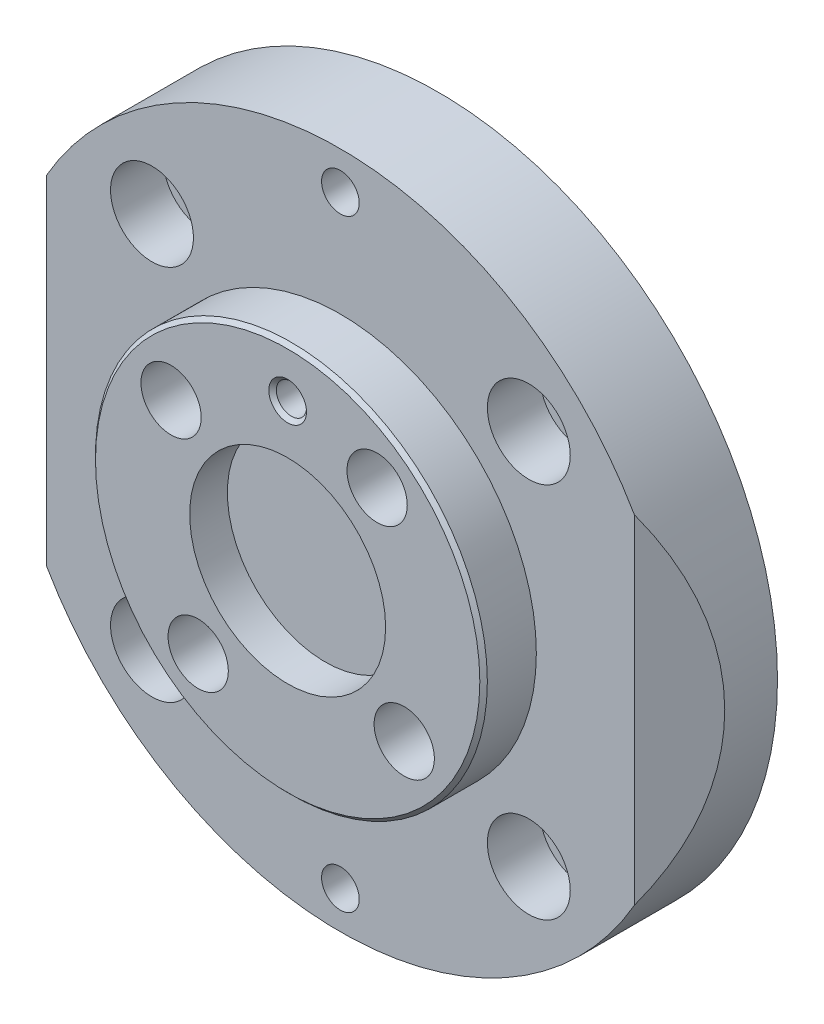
ISO-10303-21;
HEADER;
FILE_DESCRIPTION(('STEP AP214'),'2;1');
FILE_NAME('part.step','',(''),(''),'','','');
FILE_SCHEMA(('AUTOMOTIVE_DESIGN { 1 0 10303 214 1 1 1 1 }'));
ENDSEC;
DATA;
#1=APPLICATION_CONTEXT('core data for automotive mechanical design processes');
#2=APPLICATION_PROTOCOL_DEFINITION('international standard','automotive_design',2000,#1);
#3=PRODUCT_CONTEXT('',#1,'mechanical');
#4=PRODUCT('Part','Part','',(#3));
#5=PRODUCT_RELATED_PRODUCT_CATEGORY('part','',(#4));
#6=PRODUCT_DEFINITION_FORMATION('','',#4);
#7=PRODUCT_DEFINITION_CONTEXT('part definition',#1,'design');
#8=PRODUCT_DEFINITION('design','',#6,#7);
#9=PRODUCT_DEFINITION_SHAPE('','',#8);
#10=(LENGTH_UNIT() NAMED_UNIT(*) SI_UNIT(.MILLI.,.METRE.));
#11=(NAMED_UNIT(*) PLANE_ANGLE_UNIT() SI_UNIT($,.RADIAN.));
#12=(NAMED_UNIT(*) SI_UNIT($,.STERADIAN.) SOLID_ANGLE_UNIT());
#13=UNCERTAINTY_MEASURE_WITH_UNIT(LENGTH_MEASURE(1.E-05),#10,'distance_accuracy_value','');
#14=(GEOMETRIC_REPRESENTATION_CONTEXT(3) GLOBAL_UNCERTAINTY_ASSIGNED_CONTEXT((#13)) GLOBAL_UNIT_ASSIGNED_CONTEXT((#10,
#11,#12)) REPRESENTATION_CONTEXT('',''));
#15=CARTESIAN_POINT('',(0.,0.,0.));
#16=DIRECTION('',(0.,0.,1.));
#17=DIRECTION('',(1.,0.,0.));
#18=AXIS2_PLACEMENT_3D('',#15,#16,#17);
#19=CARTESIAN_POINT('',(0.,0.,20.));
#20=DIRECTION('',(0.,0.,-1.));
#21=DIRECTION('',(-1.,0.,0.));
#22=AXIS2_PLACEMENT_3D('',#19,#20,#21);
#23=CYLINDRICAL_SURFACE('',#22,45.);
#24=CARTESIAN_POINT('',(0.,0.,0.));
#25=DIRECTION('',(0.,0.,1.));
#26=DIRECTION('',(1.,0.,0.));
#27=AXIS2_PLACEMENT_3D('',#24,#25,#26);
#28=CIRCLE('',#27,45.);
#29=CARTESIAN_POINT('',(45.,0.,0.));
#30=VERTEX_POINT('',#29);
#31=EDGE_CURVE('E94',#30,#30,#28,.T.);
#32=ORIENTED_EDGE('',*,*,#31,.T.);
#33=EDGE_LOOP('',(#32));
#34=FACE_BOUND('',#33,.T.);
#35=CARTESIAN_POINT('',(0.,0.,51.9999999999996));
#36=DIRECTION('',(0.707106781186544,0.,0.707106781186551));
#37=DIRECTION('',(0.707106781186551,0.,-0.707106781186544));
#38=AXIS2_PLACEMENT_3D('',#35,#36,#37);
#39=ELLIPSE('',#38,63.639610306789,45.);
#40=CARTESIAN_POINT('',(39.,-22.4499443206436,13.));
#41=VERTEX_POINT('',#40);
#42=CARTESIAN_POINT('',(39.,22.4499443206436,13.));
#43=VERTEX_POINT('',#42);
#44=EDGE_CURVE('E64',#41,#43,#39,.T.);
#45=ORIENTED_EDGE('',*,*,#44,.F.);
#46=CARTESIAN_POINT('',(0.,0.,13.));
#47=DIRECTION('',(0.,0.,1.));
#48=DIRECTION('',(1.,0.,0.));
#49=AXIS2_PLACEMENT_3D('',#46,#47,#48);
#50=CIRCLE('',#49,45.);
#51=CARTESIAN_POINT('',(-39.,-22.4499443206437,13.));
#52=VERTEX_POINT('',#51);
#53=EDGE_CURVE('E84',#52,#41,#50,.T.);
#54=ORIENTED_EDGE('',*,*,#53,.F.);
#55=CARTESIAN_POINT('',(0.,0.,51.9999999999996));
#56=DIRECTION('',(-0.707106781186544,0.,0.707106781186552));
#57=DIRECTION('',(-0.707106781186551,0.,-0.707106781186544));
#58=AXIS2_PLACEMENT_3D('',#55,#56,#57);
#59=ELLIPSE('',#58,63.6396103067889,45.);
#60=CARTESIAN_POINT('',(-39.,22.4499443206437,13.));
#61=VERTEX_POINT('',#60);
#62=EDGE_CURVE('E71',#61,#52,#59,.T.);
#63=ORIENTED_EDGE('',*,*,#62,.F.);
#64=EDGE_CURVE('E85',#43,#61,#50,.T.);
#65=ORIENTED_EDGE('',*,*,#64,.F.);
#66=EDGE_LOOP('',(#45,#54,#63,#65));
#67=FACE_BOUND('',#66,.T.);
#68=ADVANCED_FACE('F50',(#34,#67),#23,.T.);
#69=CARTESIAN_POINT('',(0.,0.,13.));
#70=DIRECTION('',(0.,0.,1.));
#71=DIRECTION('',(1.,0.,0.));
#72=AXIS2_PLACEMENT_3D('',#69,#70,#71);
#73=PLANE('',#72);
#74=CARTESIAN_POINT('',(0.,40.,13.));
#75=DIRECTION('',(0.,0.,1.));
#76=DIRECTION('',(1.,0.,0.));
#77=AXIS2_PLACEMENT_3D('',#74,#75,#76);
#78=CIRCLE('',#77,2.49999999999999);
#79=CARTESIAN_POINT('',(2.49999999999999,40.,13.));
#80=VERTEX_POINT('',#79);
#81=EDGE_CURVE('E572',#80,#80,#78,.T.);
#82=ORIENTED_EDGE('',*,*,#81,.F.);
#83=EDGE_LOOP('',(#82));
#84=FACE_BOUND('',#83,.T.);
#85=CARTESIAN_POINT('',(0.,-40.,13.));
#86=DIRECTION('',(0.,0.,1.));
#87=DIRECTION('',(1.,0.,0.));
#88=AXIS2_PLACEMENT_3D('',#85,#86,#87);
#89=CIRCLE('',#88,2.49999999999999);
#90=CARTESIAN_POINT('',(2.5,-40.,13.));
#91=VERTEX_POINT('',#90);
#92=EDGE_CURVE('E574',#91,#91,#89,.T.);
#93=ORIENTED_EDGE('',*,*,#92,.F.);
#94=EDGE_LOOP('',(#93));
#95=FACE_BOUND('',#94,.T.);
#96=CARTESIAN_POINT('',(-25.,25.,13.));
#97=DIRECTION('',(0.,0.,1.));
#98=DIRECTION('',(1.,0.,0.));
#99=AXIS2_PLACEMENT_3D('',#96,#97,#98);
#100=CIRCLE('',#99,5.5);
#101=CARTESIAN_POINT('',(-19.5,25.,13.));
#102=VERTEX_POINT('',#101);
#103=EDGE_CURVE('E583',#102,#102,#100,.T.);
#104=ORIENTED_EDGE('',*,*,#103,.F.);
#105=EDGE_LOOP('',(#104));
#106=FACE_BOUND('',#105,.T.);
#107=CARTESIAN_POINT('',(25.,25.,13.));
#108=DIRECTION('',(0.,0.,1.));
#109=DIRECTION('',(1.,0.,0.));
#110=AXIS2_PLACEMENT_3D('',#107,#108,#109);
#111=CIRCLE('',#110,5.5);
#112=CARTESIAN_POINT('',(30.5,25.,13.));
#113=VERTEX_POINT('',#112);
#114=EDGE_CURVE('E595',#113,#113,#111,.T.);
#115=ORIENTED_EDGE('',*,*,#114,.F.);
#116=EDGE_LOOP('',(#115));
#117=FACE_BOUND('',#116,.T.);
#118=CARTESIAN_POINT('',(25.,-25.,13.));
#119=DIRECTION('',(0.,0.,1.));
#120=DIRECTION('',(1.,0.,0.));
#121=AXIS2_PLACEMENT_3D('',#118,#119,#120);
#122=CIRCLE('',#121,5.5);
#123=CARTESIAN_POINT('',(30.5,-25.,13.));
#124=VERTEX_POINT('',#123);
#125=EDGE_CURVE('E607',#124,#124,#122,.T.);
#126=ORIENTED_EDGE('',*,*,#125,.F.);
#127=EDGE_LOOP('',(#126));
#128=FACE_BOUND('',#127,.T.);
#129=CARTESIAN_POINT('',(-25.,-25.,13.));
#130=DIRECTION('',(0.,0.,1.));
#131=DIRECTION('',(1.,0.,0.));
#132=AXIS2_PLACEMENT_3D('',#129,#130,#131);
#133=CIRCLE('',#132,5.5);
#134=CARTESIAN_POINT('',(-19.5,-25.,13.));
#135=VERTEX_POINT('',#134);
#136=EDGE_CURVE('E619',#135,#135,#133,.T.);
#137=ORIENTED_EDGE('',*,*,#136,.F.);
#138=EDGE_LOOP('',(#137));
#139=FACE_BOUND('',#138,.T.);
#140=CARTESIAN_POINT('',(0.,0.,13.));
#141=DIRECTION('',(0.,0.,1.));
#142=DIRECTION('',(1.,0.,0.));
#143=AXIS2_PLACEMENT_3D('',#140,#141,#142);
#144=CIRCLE('',#143,26.);
#145=CARTESIAN_POINT('',(26.,0.,13.));
#146=VERTEX_POINT('',#145);
#147=EDGE_CURVE('E99',#146,#146,#144,.T.);
#148=ORIENTED_EDGE('',*,*,#147,.F.);
#149=EDGE_LOOP('',(#148));
#150=FACE_BOUND('',#149,.T.);
#151=ORIENTED_EDGE('',*,*,#53,.T.);
#152=DIRECTION('',(0.,1.,0.));
#153=VECTOR('',#152,1.);
#154=CARTESIAN_POINT('',(39.,0.,13.));
#155=LINE('',#154,#153);
#156=EDGE_CURVE('E87',#41,#43,#155,.T.);
#157=ORIENTED_EDGE('',*,*,#156,.T.);
#158=ORIENTED_EDGE('',*,*,#64,.T.);
#159=DIRECTION('',(0.,-1.,0.));
#160=VECTOR('',#159,1.);
#161=CARTESIAN_POINT('',(-39.,0.,13.));
#162=LINE('',#161,#160);
#163=EDGE_CURVE('E91',#61,#52,#162,.T.);
#164=ORIENTED_EDGE('',*,*,#163,.T.);
#165=EDGE_LOOP('',(#151,#157,#158,#164));
#166=FACE_BOUND('',#165,.T.);
#167=ADVANCED_FACE('F93',(#84,#95,#106,#117,#128,#139,#150,#166),#73,.T.);
#168=CARTESIAN_POINT('',(-11.8708478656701,-15.4703901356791,20.));
#169=DIRECTION('',(0.,0.,1.));
#170=DIRECTION('',(1.,0.,0.));
#171=AXIS2_PLACEMENT_3D('',#168,#169,#170);
#172=CYLINDRICAL_SURFACE('',#171,2.09999999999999);
#173=CARTESIAN_POINT('',(-11.8708478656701,-15.4703901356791,0.));
#174=DIRECTION('',(0.,0.,1.));
#175=DIRECTION('',(1.,0.,0.));
#176=AXIS2_PLACEMENT_3D('',#173,#174,#175);
#177=CIRCLE('',#176,2.09999999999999);
#178=CARTESIAN_POINT('',(-9.77084786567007,-15.4703901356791,0.));
#179=VERTEX_POINT('',#178);
#180=EDGE_CURVE('E231',#179,#179,#177,.T.);
#181=ORIENTED_EDGE('',*,*,#180,.F.);
#182=EDGE_LOOP('',(#181));
#183=FACE_BOUND('',#182,.T.);
#184=CARTESIAN_POINT('',(-11.8708478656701,-15.4703901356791,14.));
#185=DIRECTION('',(0.,0.,1.));
#186=DIRECTION('',(1.,0.,0.));
#187=AXIS2_PLACEMENT_3D('',#184,#185,#186);
#188=CIRCLE('',#187,2.09999999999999);
#189=CARTESIAN_POINT('',(-9.77084786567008,-15.4703901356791,14.));
#190=VERTEX_POINT('',#189);
#191=EDGE_CURVE('E122',#190,#190,#188,.F.);
#192=ORIENTED_EDGE('',*,*,#191,.F.);
#193=EDGE_LOOP('',(#192));
#194=FACE_BOUND('',#193,.T.);
#195=ADVANCED_FACE('F159',(#183,#194),#172,.F.);
#196=CARTESIAN_POINT('',(15.4703901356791,-11.87084786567,20.));
#197=DIRECTION('',(0.,0.,1.));
#198=DIRECTION('',(1.,0.,0.));
#199=AXIS2_PLACEMENT_3D('',#196,#197,#198);
#200=CYLINDRICAL_SURFACE('',#199,2.09999999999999);
#201=CARTESIAN_POINT('',(15.4703901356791,-11.87084786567,0.));
#202=DIRECTION('',(0.,0.,1.));
#203=DIRECTION('',(1.,0.,0.));
#204=AXIS2_PLACEMENT_3D('',#201,#202,#203);
#205=CIRCLE('',#204,2.09999999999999);
#206=CARTESIAN_POINT('',(17.5703901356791,-11.87084786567,0.));
#207=VERTEX_POINT('',#206);
#208=EDGE_CURVE('E228',#207,#207,#205,.T.);
#209=ORIENTED_EDGE('',*,*,#208,.F.);
#210=EDGE_LOOP('',(#209));
#211=FACE_BOUND('',#210,.T.);
#212=CARTESIAN_POINT('',(15.4703901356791,-11.87084786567,14.));
#213=DIRECTION('',(0.,0.,1.));
#214=DIRECTION('',(1.,0.,0.));
#215=AXIS2_PLACEMENT_3D('',#212,#213,#214);
#216=CIRCLE('',#215,2.09999999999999);
#217=CARTESIAN_POINT('',(17.5703901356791,-11.87084786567,14.));
#218=VERTEX_POINT('',#217);
#219=EDGE_CURVE('E117',#218,#218,#216,.F.);
#220=ORIENTED_EDGE('',*,*,#219,.F.);
#221=EDGE_LOOP('',(#220));
#222=FACE_BOUND('',#221,.T.);
#223=ADVANCED_FACE('F265',(#211,#222),#200,.F.);
#224=CARTESIAN_POINT('',(11.87084786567,15.4703901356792,20.));
#225=DIRECTION('',(0.,0.,1.));
#226=DIRECTION('',(1.,0.,0.));
#227=AXIS2_PLACEMENT_3D('',#224,#225,#226);
#228=CYLINDRICAL_SURFACE('',#227,2.09999999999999);
#229=CARTESIAN_POINT('',(11.87084786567,15.4703901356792,0.));
#230=DIRECTION('',(0.,0.,1.));
#231=DIRECTION('',(1.,0.,0.));
#232=AXIS2_PLACEMENT_3D('',#229,#230,#231);
#233=CIRCLE('',#232,2.09999999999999);
#234=CARTESIAN_POINT('',(13.97084786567,15.4703901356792,0.));
#235=VERTEX_POINT('',#234);
#236=EDGE_CURVE('E225',#235,#235,#233,.T.);
#237=ORIENTED_EDGE('',*,*,#236,.F.);
#238=EDGE_LOOP('',(#237));
#239=FACE_BOUND('',#238,.T.);
#240=CARTESIAN_POINT('',(11.87084786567,15.4703901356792,14.));
#241=DIRECTION('',(0.,0.,1.));
#242=DIRECTION('',(1.,0.,0.));
#243=AXIS2_PLACEMENT_3D('',#240,#241,#242);
#244=CIRCLE('',#243,2.09999999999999);
#245=CARTESIAN_POINT('',(13.97084786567,15.4703901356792,14.));
#246=VERTEX_POINT('',#245);
#247=EDGE_CURVE('E112',#246,#246,#244,.F.);
#248=ORIENTED_EDGE('',*,*,#247,.F.);
#249=EDGE_LOOP('',(#248));
#250=FACE_BOUND('',#249,.T.);
#251=ADVANCED_FACE('F269',(#239,#250),#228,.F.);
#252=CARTESIAN_POINT('',(-15.470390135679,11.8708478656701,20.));
#253=DIRECTION('',(0.,0.,1.));
#254=DIRECTION('',(1.,0.,0.));
#255=AXIS2_PLACEMENT_3D('',#252,#253,#254);
#256=CYLINDRICAL_SURFACE('',#255,2.09999999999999);
#257=CARTESIAN_POINT('',(-15.470390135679,11.8708478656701,0.));
#258=DIRECTION('',(0.,0.,1.));
#259=DIRECTION('',(1.,0.,0.));
#260=AXIS2_PLACEMENT_3D('',#257,#258,#259);
#261=CIRCLE('',#260,2.09999999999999);
#262=CARTESIAN_POINT('',(-13.370390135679,11.8708478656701,0.));
#263=VERTEX_POINT('',#262);
#264=EDGE_CURVE('E110',#263,#263,#261,.T.);
#265=ORIENTED_EDGE('',*,*,#264,.F.);
#266=EDGE_LOOP('',(#265));
#267=FACE_BOUND('',#266,.T.);
#268=CARTESIAN_POINT('',(-15.470390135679,11.8708478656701,14.));
#269=DIRECTION('',(0.,0.,1.));
#270=DIRECTION('',(1.,0.,0.));
#271=AXIS2_PLACEMENT_3D('',#268,#269,#270);
#272=CIRCLE('',#271,2.09999999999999);
#273=CARTESIAN_POINT('',(-13.370390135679,11.8708478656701,14.));
#274=VERTEX_POINT('',#273);
#275=EDGE_CURVE('E107',#274,#274,#272,.F.);
#276=ORIENTED_EDGE('',*,*,#275,.F.);
#277=EDGE_LOOP('',(#276));
#278=FACE_BOUND('',#277,.T.);
#279=ADVANCED_FACE('F252',(#267,#278),#256,.F.);
#280=CARTESIAN_POINT('',(0.,0.,0.));
#281=DIRECTION('',(0.,0.,1.));
#282=DIRECTION('',(1.,0.,0.));
#283=AXIS2_PLACEMENT_3D('',#280,#281,#282);
#284=PLANE('',#283);
#285=CARTESIAN_POINT('',(0.,0.,0.));
#286=DIRECTION('',(0.,0.,1.));
#287=DIRECTION('',(1.,0.,0.));
#288=AXIS2_PLACEMENT_3D('',#285,#286,#287);
#289=CIRCLE('',#288,7.50000000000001);
#290=CARTESIAN_POINT('',(7.50000000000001,0.,0.));
#291=VERTEX_POINT('',#290);
#292=EDGE_CURVE('E136',#291,#291,#289,.T.);
#293=ORIENTED_EDGE('',*,*,#292,.T.);
#294=EDGE_LOOP('',(#293));
#295=FACE_BOUND('',#294,.T.);
#296=CARTESIAN_POINT('',(0.,25.,0.));
#297=DIRECTION('',(0.,0.,1.));
#298=DIRECTION('',(1.,0.,0.));
#299=AXIS2_PLACEMENT_3D('',#296,#297,#298);
#300=CIRCLE('',#299,7.49999999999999);
#301=CARTESIAN_POINT('',(7.49999999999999,25.,0.));
#302=VERTEX_POINT('',#301);
#303=EDGE_CURVE('E130',#302,#302,#300,.T.);
#304=ORIENTED_EDGE('',*,*,#303,.T.);
#305=EDGE_LOOP('',(#304));
#306=FACE_BOUND('',#305,.T.);
#307=CARTESIAN_POINT('',(0.,40.,0.));
#308=DIRECTION('',(0.,0.,1.));
#309=DIRECTION('',(1.,0.,0.));
#310=AXIS2_PLACEMENT_3D('',#307,#308,#309);
#311=CIRCLE('',#310,2.5);
#312=CARTESIAN_POINT('',(2.49999999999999,40.,0.));
#313=VERTEX_POINT('',#312);
#314=EDGE_CURVE('E569',#313,#313,#311,.T.);
#315=ORIENTED_EDGE('',*,*,#314,.T.);
#316=EDGE_LOOP('',(#315));
#317=FACE_BOUND('',#316,.T.);
#318=CARTESIAN_POINT('',(0.,-40.,0.));
#319=DIRECTION('',(0.,0.,1.));
#320=DIRECTION('',(1.,0.,0.));
#321=AXIS2_PLACEMENT_3D('',#318,#319,#320);
#322=CIRCLE('',#321,2.5);
#323=CARTESIAN_POINT('',(2.5,-40.,0.));
#324=VERTEX_POINT('',#323);
#325=EDGE_CURVE('E580',#324,#324,#322,.T.);
#326=ORIENTED_EDGE('',*,*,#325,.T.);
#327=EDGE_LOOP('',(#326));
#328=FACE_BOUND('',#327,.T.);
#329=CARTESIAN_POINT('',(-25.,25.,0.));
#330=DIRECTION('',(0.,0.,1.));
#331=DIRECTION('',(1.,0.,0.));
#332=AXIS2_PLACEMENT_3D('',#329,#330,#331);
#333=CIRCLE('',#332,3.2);
#334=CARTESIAN_POINT('',(-21.8,25.,0.));
#335=VERTEX_POINT('',#334);
#336=EDGE_CURVE('E592',#335,#335,#333,.T.);
#337=ORIENTED_EDGE('',*,*,#336,.T.);
#338=EDGE_LOOP('',(#337));
#339=FACE_BOUND('',#338,.T.);
#340=CARTESIAN_POINT('',(25.,25.,0.));
#341=DIRECTION('',(0.,0.,1.));
#342=DIRECTION('',(1.,0.,0.));
#343=AXIS2_PLACEMENT_3D('',#340,#341,#342);
#344=CIRCLE('',#343,3.2);
#345=CARTESIAN_POINT('',(28.2,25.,0.));
#346=VERTEX_POINT('',#345);
#347=EDGE_CURVE('E604',#346,#346,#344,.T.);
#348=ORIENTED_EDGE('',*,*,#347,.T.);
#349=EDGE_LOOP('',(#348));
#350=FACE_BOUND('',#349,.T.);
#351=CARTESIAN_POINT('',(25.,-25.,0.));
#352=DIRECTION('',(0.,0.,1.));
#353=DIRECTION('',(1.,0.,0.));
#354=AXIS2_PLACEMENT_3D('',#351,#352,#353);
#355=CIRCLE('',#354,3.2);
#356=CARTESIAN_POINT('',(28.2,-25.,0.));
#357=VERTEX_POINT('',#356);
#358=EDGE_CURVE('E616',#357,#357,#355,.T.);
#359=ORIENTED_EDGE('',*,*,#358,.T.);
#360=EDGE_LOOP('',(#359));
#361=FACE_BOUND('',#360,.T.);
#362=CARTESIAN_POINT('',(-25.,-25.,0.));
#363=DIRECTION('',(0.,0.,1.));
#364=DIRECTION('',(1.,0.,0.));
#365=AXIS2_PLACEMENT_3D('',#362,#363,#364);
#366=CIRCLE('',#365,3.2);
#367=CARTESIAN_POINT('',(-21.8,-25.,0.));
#368=VERTEX_POINT('',#367);
#369=EDGE_CURVE('E194',#368,#368,#366,.T.);
#370=ORIENTED_EDGE('',*,*,#369,.T.);
#371=EDGE_LOOP('',(#370));
#372=FACE_BOUND('',#371,.T.);
#373=ORIENTED_EDGE('',*,*,#264,.T.);
#374=EDGE_LOOP('',(#373));
#375=FACE_BOUND('',#374,.T.);
#376=ORIENTED_EDGE('',*,*,#236,.T.);
#377=EDGE_LOOP('',(#376));
#378=FACE_BOUND('',#377,.T.);
#379=ORIENTED_EDGE('',*,*,#208,.T.);
#380=EDGE_LOOP('',(#379));
#381=FACE_BOUND('',#380,.T.);
#382=ORIENTED_EDGE('',*,*,#180,.T.);
#383=EDGE_LOOP('',(#382));
#384=FACE_BOUND('',#383,.T.);
#385=ORIENTED_EDGE('',*,*,#31,.F.);
#386=EDGE_LOOP('',(#385));
#387=FACE_BOUND('',#386,.T.);
#388=ADVANCED_FACE('F164',(#295,#306,#317,#328,#339,#350,#361,#372,#375,#378,#381,#384,#387),
#284,.F.);
#389=CARTESIAN_POINT('',(0.,0.,13.));
#390=DIRECTION('',(0.,0.,1.));
#391=DIRECTION('',(1.,0.,0.));
#392=AXIS2_PLACEMENT_3D('',#389,#390,#391);
#393=CYLINDRICAL_SURFACE('',#392,26.);
#394=CARTESIAN_POINT('',(0.,0.,19.5));
#395=DIRECTION('',(0.,0.,1.));
#396=DIRECTION('',(1.,0.,0.));
#397=AXIS2_PLACEMENT_3D('',#394,#395,#396);
#398=CIRCLE('',#397,26.);
#399=CARTESIAN_POINT('',(26.,0.,19.5));
#400=VERTEX_POINT('',#399);
#401=EDGE_CURVE('E104',#400,#400,#398,.F.);
#402=ORIENTED_EDGE('',*,*,#401,.T.);
#403=EDGE_LOOP('',(#402));
#404=FACE_BOUND('',#403,.T.);
#405=ORIENTED_EDGE('',*,*,#147,.T.);
#406=EDGE_LOOP('',(#405));
#407=FACE_BOUND('',#406,.T.);
#408=ADVANCED_FACE('F242',(#404,#407),#393,.T.);
#409=CARTESIAN_POINT('',(0.,0.,20.));
#410=DIRECTION('',(0.,0.,1.));
#411=DIRECTION('',(1.,0.,0.));
#412=AXIS2_PLACEMENT_3D('',#409,#410,#411);
#413=PLANE('',#412);
#414=CARTESIAN_POINT('',(0.,19.5,20.));
#415=DIRECTION('',(0.,0.,1.));
#416=DIRECTION('',(1.,0.,0.));
#417=AXIS2_PLACEMENT_3D('',#414,#415,#416);
#418=CIRCLE('',#417,2.49999999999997);
#419=CARTESIAN_POINT('',(2.49999999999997,19.5,20.));
#420=VERTEX_POINT('',#419);
#421=EDGE_CURVE('E14',#420,#420,#418,.F.);
#422=ORIENTED_EDGE('',*,*,#421,.T.);
#423=EDGE_LOOP('',(#422));
#424=FACE_BOUND('',#423,.T.);
#425=CARTESIAN_POINT('',(-11.8708478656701,-15.4703901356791,20.));
#426=DIRECTION('',(0.,0.,1.));
#427=DIRECTION('',(1.,0.,0.));
#428=AXIS2_PLACEMENT_3D('',#425,#426,#427);
#429=CIRCLE('',#428,4.);
#430=CARTESIAN_POINT('',(-7.87084786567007,-15.4703901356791,20.));
#431=VERTEX_POINT('',#430);
#432=EDGE_CURVE('E206',#431,#431,#429,.T.);
#433=ORIENTED_EDGE('',*,*,#432,.F.);
#434=EDGE_LOOP('',(#433));
#435=FACE_BOUND('',#434,.T.);
#436=CARTESIAN_POINT('',(15.4703901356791,-11.87084786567,20.));
#437=DIRECTION('',(0.,0.,1.));
#438=DIRECTION('',(1.,0.,0.));
#439=AXIS2_PLACEMENT_3D('',#436,#437,#438);
#440=CIRCLE('',#439,4.);
#441=CARTESIAN_POINT('',(19.4703901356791,-11.87084786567,20.));
#442=VERTEX_POINT('',#441);
#443=EDGE_CURVE('E125',#442,#442,#440,.T.);
#444=ORIENTED_EDGE('',*,*,#443,.F.);
#445=EDGE_LOOP('',(#444));
#446=FACE_BOUND('',#445,.T.);
#447=CARTESIAN_POINT('',(11.87084786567,15.4703901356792,20.));
#448=DIRECTION('',(0.,0.,1.));
#449=DIRECTION('',(1.,0.,0.));
#450=AXIS2_PLACEMENT_3D('',#447,#448,#449);
#451=CIRCLE('',#450,4.);
#452=CARTESIAN_POINT('',(15.87084786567,15.4703901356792,20.));
#453=VERTEX_POINT('',#452);
#454=EDGE_CURVE('E120',#453,#453,#451,.T.);
#455=ORIENTED_EDGE('',*,*,#454,.F.);
#456=EDGE_LOOP('',(#455));
#457=FACE_BOUND('',#456,.T.);
#458=CARTESIAN_POINT('',(-15.470390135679,11.8708478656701,20.));
#459=DIRECTION('',(0.,0.,1.));
#460=DIRECTION('',(1.,0.,0.));
#461=AXIS2_PLACEMENT_3D('',#458,#459,#460);
#462=CIRCLE('',#461,4.);
#463=CARTESIAN_POINT('',(-11.470390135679,11.8708478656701,20.));
#464=VERTEX_POINT('',#463);
#465=EDGE_CURVE('E115',#464,#464,#462,.T.);
#466=ORIENTED_EDGE('',*,*,#465,.F.);
#467=EDGE_LOOP('',(#466));
#468=FACE_BOUND('',#467,.T.);
#469=CARTESIAN_POINT('',(0.,0.,20.));
#470=DIRECTION('',(0.,0.,1.));
#471=DIRECTION('',(1.,0.,0.));
#472=AXIS2_PLACEMENT_3D('',#469,#470,#471);
#473=CIRCLE('',#472,13.);
#474=CARTESIAN_POINT('',(13.,0.,20.));
#475=VERTEX_POINT('',#474);
#476=EDGE_CURVE('E234',#475,#475,#473,.T.);
#477=ORIENTED_EDGE('',*,*,#476,.F.);
#478=EDGE_LOOP('',(#477));
#479=FACE_BOUND('',#478,.T.);
#480=CARTESIAN_POINT('',(0.,0.,20.));
#481=DIRECTION('',(0.,0.,1.));
#482=DIRECTION('',(1.,0.,0.));
#483=AXIS2_PLACEMENT_3D('',#480,#481,#482);
#484=CIRCLE('',#483,25.5);
#485=CARTESIAN_POINT('',(25.5,0.,20.));
#486=VERTEX_POINT('',#485);
#487=EDGE_CURVE('E97',#486,#486,#484,.T.);
#488=ORIENTED_EDGE('',*,*,#487,.T.);
#489=EDGE_LOOP('',(#488));
#490=FACE_BOUND('',#489,.T.);
#491=ADVANCED_FACE('F170',(#424,#435,#446,#457,#468,#479,#490),#413,.T.);
#492=CARTESIAN_POINT('',(0.,0.,20.));
#493=DIRECTION('',(0.,0.,-1.));
#494=DIRECTION('',(-1.,0.,0.));
#495=AXIS2_PLACEMENT_3D('',#492,#493,#494);
#496=CONICAL_SURFACE('',#495,25.5,0.785398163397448);
#497=ORIENTED_EDGE('',*,*,#401,.F.);
#498=EDGE_LOOP('',(#497));
#499=FACE_BOUND('',#498,.T.);
#500=ORIENTED_EDGE('',*,*,#487,.F.);
#501=EDGE_LOOP('',(#500));
#502=FACE_BOUND('',#501,.T.);
#503=ADVANCED_FACE('F166',(#499,#502),#496,.T.);
#504=CARTESIAN_POINT('',(0.,0.,15.));
#505=DIRECTION('',(0.,0.,1.));
#506=DIRECTION('',(1.,0.,0.));
#507=AXIS2_PLACEMENT_3D('',#504,#505,#506);
#508=CYLINDRICAL_SURFACE('',#507,13.);
#509=CARTESIAN_POINT('',(0.,0.,15.));
#510=DIRECTION('',(0.,0.,1.));
#511=DIRECTION('',(1.,0.,0.));
#512=AXIS2_PLACEMENT_3D('',#509,#510,#511);
#513=CIRCLE('',#512,13.);
#514=CARTESIAN_POINT('',(13.,0.,15.));
#515=VERTEX_POINT('',#514);
#516=EDGE_CURVE('E235',#515,#515,#513,.T.);
#517=ORIENTED_EDGE('',*,*,#516,.F.);
#518=EDGE_LOOP('',(#517));
#519=FACE_BOUND('',#518,.T.);
#520=ORIENTED_EDGE('',*,*,#476,.T.);
#521=EDGE_LOOP('',(#520));
#522=FACE_BOUND('',#521,.T.);
#523=ADVANCED_FACE('F169',(#519,#522),#508,.F.);
#524=CARTESIAN_POINT('',(0.,0.,15.));
#525=DIRECTION('',(0.,0.,1.));
#526=DIRECTION('',(1.,0.,0.));
#527=AXIS2_PLACEMENT_3D('',#524,#525,#526);
#528=PLANE('',#527);
#529=ORIENTED_EDGE('',*,*,#516,.T.);
#530=EDGE_LOOP('',(#529));
#531=FACE_BOUND('',#530,.T.);
#532=ADVANCED_FACE('F257',(#531),#528,.T.);
#533=CARTESIAN_POINT('',(-15.470390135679,11.8708478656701,14.));
#534=DIRECTION('',(0.,0.,1.));
#535=DIRECTION('',(1.,0.,0.));
#536=AXIS2_PLACEMENT_3D('',#533,#534,#535);
#537=PLANE('',#536);
#538=CARTESIAN_POINT('',(-15.470390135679,11.8708478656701,14.));
#539=DIRECTION('',(0.,0.,1.));
#540=DIRECTION('',(1.,0.,0.));
#541=AXIS2_PLACEMENT_3D('',#538,#539,#540);
#542=CIRCLE('',#541,4.);
#543=CARTESIAN_POINT('',(-11.470390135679,11.8708478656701,14.));
#544=VERTEX_POINT('',#543);
#545=EDGE_CURVE('E111',#544,#544,#542,.T.);
#546=ORIENTED_EDGE('',*,*,#545,.T.);
#547=EDGE_LOOP('',(#546));
#548=FACE_BOUND('',#547,.T.);
#549=ORIENTED_EDGE('',*,*,#275,.T.);
#550=EDGE_LOOP('',(#549));
#551=FACE_BOUND('',#550,.T.);
#552=ADVANCED_FACE('F261',(#548,#551),#537,.T.);
#553=CARTESIAN_POINT('',(-15.470390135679,11.8708478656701,14.));
#554=DIRECTION('',(0.,0.,1.));
#555=DIRECTION('',(1.,0.,0.));
#556=AXIS2_PLACEMENT_3D('',#553,#554,#555);
#557=CYLINDRICAL_SURFACE('',#556,4.);
#558=ORIENTED_EDGE('',*,*,#545,.F.);
#559=EDGE_LOOP('',(#558));
#560=FACE_BOUND('',#559,.T.);
#561=ORIENTED_EDGE('',*,*,#465,.T.);
#562=EDGE_LOOP('',(#561));
#563=FACE_BOUND('',#562,.T.);
#564=ADVANCED_FACE('F277',(#560,#563),#557,.F.);
#565=CARTESIAN_POINT('',(11.87084786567,15.4703901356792,14.));
#566=DIRECTION('',(0.,0.,1.));
#567=DIRECTION('',(1.,0.,0.));
#568=AXIS2_PLACEMENT_3D('',#565,#566,#567);
#569=PLANE('',#568);
#570=CARTESIAN_POINT('',(11.87084786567,15.4703901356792,14.));
#571=DIRECTION('',(0.,0.,1.));
#572=DIRECTION('',(1.,0.,0.));
#573=AXIS2_PLACEMENT_3D('',#570,#571,#572);
#574=CIRCLE('',#573,4.);
#575=CARTESIAN_POINT('',(15.87084786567,15.4703901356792,14.));
#576=VERTEX_POINT('',#575);
#577=EDGE_CURVE('E116',#576,#576,#574,.T.);
#578=ORIENTED_EDGE('',*,*,#577,.T.);
#579=EDGE_LOOP('',(#578));
#580=FACE_BOUND('',#579,.T.);
#581=ORIENTED_EDGE('',*,*,#247,.T.);
#582=EDGE_LOOP('',(#581));
#583=FACE_BOUND('',#582,.T.);
#584=ADVANCED_FACE('F280',(#580,#583),#569,.T.);
#585=CARTESIAN_POINT('',(11.87084786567,15.4703901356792,14.));
#586=DIRECTION('',(0.,0.,1.));
#587=DIRECTION('',(1.,0.,0.));
#588=AXIS2_PLACEMENT_3D('',#585,#586,#587);
#589=CYLINDRICAL_SURFACE('',#588,4.);
#590=ORIENTED_EDGE('',*,*,#577,.F.);
#591=EDGE_LOOP('',(#590));
#592=FACE_BOUND('',#591,.T.);
#593=ORIENTED_EDGE('',*,*,#454,.T.);
#594=EDGE_LOOP('',(#593));
#595=FACE_BOUND('',#594,.T.);
#596=ADVANCED_FACE('F285',(#592,#595),#589,.F.);
#597=CARTESIAN_POINT('',(15.4703901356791,-11.87084786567,14.));
#598=DIRECTION('',(0.,0.,1.));
#599=DIRECTION('',(1.,0.,0.));
#600=AXIS2_PLACEMENT_3D('',#597,#598,#599);
#601=PLANE('',#600);
#602=CARTESIAN_POINT('',(15.4703901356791,-11.87084786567,14.));
#603=DIRECTION('',(0.,0.,1.));
#604=DIRECTION('',(1.,0.,0.));
#605=AXIS2_PLACEMENT_3D('',#602,#603,#604);
#606=CIRCLE('',#605,4.);
#607=CARTESIAN_POINT('',(19.4703901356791,-11.87084786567,14.));
#608=VERTEX_POINT('',#607);
#609=EDGE_CURVE('E121',#608,#608,#606,.T.);
#610=ORIENTED_EDGE('',*,*,#609,.T.);
#611=EDGE_LOOP('',(#610));
#612=FACE_BOUND('',#611,.T.);
#613=ORIENTED_EDGE('',*,*,#219,.T.);
#614=EDGE_LOOP('',(#613));
#615=FACE_BOUND('',#614,.T.);
#616=ADVANCED_FACE('F288',(#612,#615),#601,.T.);
#617=CARTESIAN_POINT('',(15.4703901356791,-11.87084786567,14.));
#618=DIRECTION('',(0.,0.,1.));
#619=DIRECTION('',(1.,0.,0.));
#620=AXIS2_PLACEMENT_3D('',#617,#618,#619);
#621=CYLINDRICAL_SURFACE('',#620,4.);
#622=ORIENTED_EDGE('',*,*,#609,.F.);
#623=EDGE_LOOP('',(#622));
#624=FACE_BOUND('',#623,.T.);
#625=ORIENTED_EDGE('',*,*,#443,.T.);
#626=EDGE_LOOP('',(#625));
#627=FACE_BOUND('',#626,.T.);
#628=ADVANCED_FACE('F293',(#624,#627),#621,.F.);
#629=CARTESIAN_POINT('',(-11.8708478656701,-15.4703901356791,14.));
#630=DIRECTION('',(0.,0.,1.));
#631=DIRECTION('',(1.,0.,0.));
#632=AXIS2_PLACEMENT_3D('',#629,#630,#631);
#633=PLANE('',#632);
#634=CARTESIAN_POINT('',(-11.8708478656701,-15.4703901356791,14.));
#635=DIRECTION('',(0.,0.,1.));
#636=DIRECTION('',(1.,0.,0.));
#637=AXIS2_PLACEMENT_3D('',#634,#635,#636);
#638=CIRCLE('',#637,4.);
#639=CARTESIAN_POINT('',(-7.87084786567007,-15.4703901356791,14.));
#640=VERTEX_POINT('',#639);
#641=EDGE_CURVE('E126',#640,#640,#638,.T.);
#642=ORIENTED_EDGE('',*,*,#641,.T.);
#643=EDGE_LOOP('',(#642));
#644=FACE_BOUND('',#643,.T.);
#645=ORIENTED_EDGE('',*,*,#191,.T.);
#646=EDGE_LOOP('',(#645));
#647=FACE_BOUND('',#646,.T.);
#648=ADVANCED_FACE('F296',(#644,#647),#633,.T.);
#649=CARTESIAN_POINT('',(-11.8708478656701,-15.4703901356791,14.));
#650=DIRECTION('',(0.,0.,1.));
#651=DIRECTION('',(1.,0.,0.));
#652=AXIS2_PLACEMENT_3D('',#649,#650,#651);
#653=CYLINDRICAL_SURFACE('',#652,4.);
#654=ORIENTED_EDGE('',*,*,#641,.F.);
#655=EDGE_LOOP('',(#654));
#656=FACE_BOUND('',#655,.T.);
#657=ORIENTED_EDGE('',*,*,#432,.T.);
#658=EDGE_LOOP('',(#657));
#659=FACE_BOUND('',#658,.T.);
#660=ADVANCED_FACE('F301',(#656,#659),#653,.F.);
#661=CARTESIAN_POINT('',(0.,19.5,9.99999999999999));
#662=DIRECTION('',(0.,0.,1.));
#663=DIRECTION('',(1.,0.,0.));
#664=AXIS2_PLACEMENT_3D('',#661,#662,#663);
#665=CONICAL_SURFACE('',#664,2.,1.02974425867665);
#666=CARTESIAN_POINT('',(0.,19.5,8.79827876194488));
#667=VERTEX_POINT('',#666);
#668=VERTEX_LOOP('',#667);
#669=FACE_BOUND('',#668,.T.);
#670=CARTESIAN_POINT('',(0.,19.5,9.99999999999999));
#671=DIRECTION('',(0.,0.,1.));
#672=DIRECTION('',(1.,0.,0.));
#673=AXIS2_PLACEMENT_3D('',#670,#671,#672);
#674=CIRCLE('',#673,2.);
#675=CARTESIAN_POINT('',(2.,19.5,9.99999999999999));
#676=VERTEX_POINT('',#675);
#677=EDGE_CURVE('E197',#676,#676,#674,.T.);
#678=ORIENTED_EDGE('',*,*,#677,.T.);
#679=EDGE_LOOP('',(#678));
#680=FACE_BOUND('',#679,.T.);
#681=ADVANCED_FACE('F304',(#669,#680),#665,.F.);
#682=CARTESIAN_POINT('',(0.,19.5,20.));
#683=DIRECTION('',(0.,0.,1.));
#684=DIRECTION('',(1.,0.,0.));
#685=AXIS2_PLACEMENT_3D('',#682,#683,#684);
#686=CYLINDRICAL_SURFACE('',#685,2.);
#687=CARTESIAN_POINT('',(0.,19.5,19.5));
#688=DIRECTION('',(0.,0.,1.));
#689=DIRECTION('',(1.,0.,0.));
#690=AXIS2_PLACEMENT_3D('',#687,#688,#689);
#691=CIRCLE('',#690,2.);
#692=CARTESIAN_POINT('',(2.,19.5,19.5));
#693=VERTEX_POINT('',#692);
#694=EDGE_CURVE('E58',#693,#693,#691,.T.);
#695=ORIENTED_EDGE('',*,*,#694,.T.);
#696=EDGE_LOOP('',(#695));
#697=FACE_BOUND('',#696,.T.);
#698=ORIENTED_EDGE('',*,*,#677,.F.);
#699=EDGE_LOOP('',(#698));
#700=FACE_BOUND('',#699,.T.);
#701=ADVANCED_FACE('F141',(#697,#700),#686,.F.);
#702=CARTESIAN_POINT('',(0.,0.,5.50000000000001));
#703=DIRECTION('',(0.,0.,-1.));
#704=DIRECTION('',(-1.,0.,0.));
#705=AXIS2_PLACEMENT_3D('',#702,#703,#704);
#706=CYLINDRICAL_SURFACE('',#705,7.);
#707=CARTESIAN_POINT('',(0.,0.,0.5));
#708=DIRECTION('',(0.,0.,1.));
#709=DIRECTION('',(1.,0.,0.));
#710=AXIS2_PLACEMENT_3D('',#707,#708,#709);
#711=CIRCLE('',#710,7.);
#712=CARTESIAN_POINT('',(7.,0.,0.5));
#713=VERTEX_POINT('',#712);
#714=EDGE_CURVE('E133',#713,#713,#711,.F.);
#715=ORIENTED_EDGE('',*,*,#714,.T.);
#716=EDGE_LOOP('',(#715));
#717=FACE_BOUND('',#716,.T.);
#718=CARTESIAN_POINT('',(0.,0.,5.50000000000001));
#719=DIRECTION('',(0.,0.,-1.));
#720=DIRECTION('',(-1.,0.,0.));
#721=AXIS2_PLACEMENT_3D('',#718,#719,#720);
#722=CIRCLE('',#721,7.);
#723=CARTESIAN_POINT('',(-7.,0.,5.50000000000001));
#724=VERTEX_POINT('',#723);
#725=EDGE_CURVE('E193',#724,#724,#722,.T.);
#726=ORIENTED_EDGE('',*,*,#725,.F.);
#727=EDGE_LOOP('',(#726));
#728=FACE_BOUND('',#727,.T.);
#729=ADVANCED_FACE('F314',(#717,#728),#706,.F.);
#730=CARTESIAN_POINT('',(0.,0.,5.50000000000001));
#731=DIRECTION('',(0.,0.,-1.));
#732=DIRECTION('',(-1.,0.,0.));
#733=AXIS2_PLACEMENT_3D('',#730,#731,#732);
#734=PLANE('',#733);
#735=ORIENTED_EDGE('',*,*,#725,.T.);
#736=EDGE_LOOP('',(#735));
#737=FACE_BOUND('',#736,.T.);
#738=ADVANCED_FACE('F187',(#737),#734,.T.);
#739=CARTESIAN_POINT('',(0.,25.,5.50000000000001));
#740=DIRECTION('',(0.,0.,-1.));
#741=DIRECTION('',(-1.,0.,0.));
#742=AXIS2_PLACEMENT_3D('',#739,#740,#741);
#743=CYLINDRICAL_SURFACE('',#742,7.);
#744=CARTESIAN_POINT('',(0.,25.,0.499999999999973));
#745=DIRECTION('',(0.,0.,1.));
#746=DIRECTION('',(1.,0.,0.));
#747=AXIS2_PLACEMENT_3D('',#744,#745,#746);
#748=CIRCLE('',#747,7.);
#749=CARTESIAN_POINT('',(7.,25.,0.499999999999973));
#750=VERTEX_POINT('',#749);
#751=EDGE_CURVE('E90',#750,#750,#748,.F.);
#752=ORIENTED_EDGE('',*,*,#751,.T.);
#753=EDGE_LOOP('',(#752));
#754=FACE_BOUND('',#753,.T.);
#755=CARTESIAN_POINT('',(0.,25.,5.50000000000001));
#756=DIRECTION('',(0.,0.,-1.));
#757=DIRECTION('',(-1.,0.,0.));
#758=AXIS2_PLACEMENT_3D('',#755,#756,#757);
#759=CIRCLE('',#758,7.);
#760=CARTESIAN_POINT('',(-7.,25.,5.50000000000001));
#761=VERTEX_POINT('',#760);
#762=EDGE_CURVE('E191',#761,#761,#759,.T.);
#763=ORIENTED_EDGE('',*,*,#762,.F.);
#764=EDGE_LOOP('',(#763));
#765=FACE_BOUND('',#764,.T.);
#766=ADVANCED_FACE('F183',(#754,#765),#743,.F.);
#767=CARTESIAN_POINT('',(0.,25.,5.50000000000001));
#768=DIRECTION('',(0.,0.,-1.));
#769=DIRECTION('',(-1.,0.,0.));
#770=AXIS2_PLACEMENT_3D('',#767,#768,#769);
#771=PLANE('',#770);
#772=ORIENTED_EDGE('',*,*,#762,.T.);
#773=EDGE_LOOP('',(#772));
#774=FACE_BOUND('',#773,.T.);
#775=ADVANCED_FACE('F186',(#774),#771,.T.);
#776=CARTESIAN_POINT('',(-25.,-25.,13.));
#777=DIRECTION('',(0.,0.,1.));
#778=DIRECTION('',(1.,0.,0.));
#779=AXIS2_PLACEMENT_3D('',#776,#777,#778);
#780=CYLINDRICAL_SURFACE('',#779,3.2);
#781=ORIENTED_EDGE('',*,*,#369,.F.);
#782=EDGE_LOOP('',(#781));
#783=FACE_BOUND('',#782,.T.);
#784=CARTESIAN_POINT('',(-25.,-25.,6.00000000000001));
#785=DIRECTION('',(0.,0.,1.));
#786=DIRECTION('',(1.,0.,0.));
#787=AXIS2_PLACEMENT_3D('',#784,#785,#786);
#788=CIRCLE('',#787,3.2);
#789=CARTESIAN_POINT('',(-21.8,-25.,6.00000000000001));
#790=VERTEX_POINT('',#789);
#791=EDGE_CURVE('E200',#790,#790,#788,.T.);
#792=ORIENTED_EDGE('',*,*,#791,.T.);
#793=EDGE_LOOP('',(#792));
#794=FACE_BOUND('',#793,.T.);
#795=ADVANCED_FACE('F323',(#783,#794),#780,.F.);
#796=CARTESIAN_POINT('',(-21.8,-25.,6.00000000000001));
#797=DIRECTION('',(0.,0.,-1.));
#798=DIRECTION('',(-1.,0.,0.));
#799=AXIS2_PLACEMENT_3D('',#796,#797,#798);
#800=PLANE('',#799);
#801=ORIENTED_EDGE('',*,*,#791,.F.);
#802=EDGE_LOOP('',(#801));
#803=FACE_BOUND('',#802,.T.);
#804=CARTESIAN_POINT('',(-25.,-25.,6.00000000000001));
#805=DIRECTION('',(0.,0.,1.));
#806=DIRECTION('',(1.,0.,0.));
#807=AXIS2_PLACEMENT_3D('',#804,#805,#806);
#808=CIRCLE('',#807,5.5);
#809=CARTESIAN_POINT('',(-19.5,-25.,6.00000000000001));
#810=VERTEX_POINT('',#809);
#811=EDGE_CURVE('E622',#810,#810,#808,.T.);
#812=ORIENTED_EDGE('',*,*,#811,.T.);
#813=EDGE_LOOP('',(#812));
#814=FACE_BOUND('',#813,.T.);
#815=ADVANCED_FACE('F326',(#803,#814),#800,.F.);
#816=CARTESIAN_POINT('',(-25.,-25.,13.));
#817=DIRECTION('',(0.,0.,1.));
#818=DIRECTION('',(1.,0.,0.));
#819=AXIS2_PLACEMENT_3D('',#816,#817,#818);
#820=CYLINDRICAL_SURFACE('',#819,5.5);
#821=ORIENTED_EDGE('',*,*,#811,.F.);
#822=EDGE_LOOP('',(#821));
#823=FACE_BOUND('',#822,.T.);
#824=ORIENTED_EDGE('',*,*,#136,.T.);
#825=EDGE_LOOP('',(#824));
#826=FACE_BOUND('',#825,.T.);
#827=ADVANCED_FACE('F330',(#823,#826),#820,.F.);
#828=CARTESIAN_POINT('',(25.,-25.,13.));
#829=DIRECTION('',(0.,0.,1.));
#830=DIRECTION('',(1.,0.,0.));
#831=AXIS2_PLACEMENT_3D('',#828,#829,#830);
#832=CYLINDRICAL_SURFACE('',#831,3.2);
#833=ORIENTED_EDGE('',*,*,#358,.F.);
#834=EDGE_LOOP('',(#833));
#835=FACE_BOUND('',#834,.T.);
#836=CARTESIAN_POINT('',(25.,-25.,6.00000000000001));
#837=DIRECTION('',(0.,0.,1.));
#838=DIRECTION('',(1.,0.,0.));
#839=AXIS2_PLACEMENT_3D('',#836,#837,#838);
#840=CIRCLE('',#839,3.2);
#841=CARTESIAN_POINT('',(28.2,-25.,6.00000000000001));
#842=VERTEX_POINT('',#841);
#843=EDGE_CURVE('E613',#842,#842,#840,.T.);
#844=ORIENTED_EDGE('',*,*,#843,.T.);
#845=EDGE_LOOP('',(#844));
#846=FACE_BOUND('',#845,.T.);
#847=ADVANCED_FACE('F334',(#835,#846),#832,.F.);
#848=CARTESIAN_POINT('',(28.2,-25.,6.00000000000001));
#849=DIRECTION('',(0.,0.,-1.));
#850=DIRECTION('',(-1.,0.,0.));
#851=AXIS2_PLACEMENT_3D('',#848,#849,#850);
#852=PLANE('',#851);
#853=ORIENTED_EDGE('',*,*,#843,.F.);
#854=EDGE_LOOP('',(#853));
#855=FACE_BOUND('',#854,.T.);
#856=CARTESIAN_POINT('',(25.,-25.,6.00000000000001));
#857=DIRECTION('',(0.,0.,1.));
#858=DIRECTION('',(1.,0.,0.));
#859=AXIS2_PLACEMENT_3D('',#856,#857,#858);
#860=CIRCLE('',#859,5.5);
#861=CARTESIAN_POINT('',(30.5,-25.,6.00000000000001));
#862=VERTEX_POINT('',#861);
#863=EDGE_CURVE('E610',#862,#862,#860,.T.);
#864=ORIENTED_EDGE('',*,*,#863,.T.);
#865=EDGE_LOOP('',(#864));
#866=FACE_BOUND('',#865,.T.);
#867=ADVANCED_FACE('F338',(#855,#866),#852,.F.);
#868=CARTESIAN_POINT('',(25.,-25.,13.));
#869=DIRECTION('',(0.,0.,1.));
#870=DIRECTION('',(1.,0.,0.));
#871=AXIS2_PLACEMENT_3D('',#868,#869,#870);
#872=CYLINDRICAL_SURFACE('',#871,5.5);
#873=ORIENTED_EDGE('',*,*,#863,.F.);
#874=EDGE_LOOP('',(#873));
#875=FACE_BOUND('',#874,.T.);
#876=ORIENTED_EDGE('',*,*,#125,.T.);
#877=EDGE_LOOP('',(#876));
#878=FACE_BOUND('',#877,.T.);
#879=ADVANCED_FACE('F342',(#875,#878),#872,.F.);
#880=CARTESIAN_POINT('',(25.,25.,13.));
#881=DIRECTION('',(0.,0.,1.));
#882=DIRECTION('',(1.,0.,0.));
#883=AXIS2_PLACEMENT_3D('',#880,#881,#882);
#884=CYLINDRICAL_SURFACE('',#883,3.2);
#885=ORIENTED_EDGE('',*,*,#347,.F.);
#886=EDGE_LOOP('',(#885));
#887=FACE_BOUND('',#886,.T.);
#888=CARTESIAN_POINT('',(25.,25.,6.00000000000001));
#889=DIRECTION('',(0.,0.,1.));
#890=DIRECTION('',(1.,0.,0.));
#891=AXIS2_PLACEMENT_3D('',#888,#889,#890);
#892=CIRCLE('',#891,3.2);
#893=CARTESIAN_POINT('',(28.2,25.,6.00000000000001));
#894=VERTEX_POINT('',#893);
#895=EDGE_CURVE('E601',#894,#894,#892,.T.);
#896=ORIENTED_EDGE('',*,*,#895,.T.);
#897=EDGE_LOOP('',(#896));
#898=FACE_BOUND('',#897,.T.);
#899=ADVANCED_FACE('F346',(#887,#898),#884,.F.);
#900=CARTESIAN_POINT('',(28.2,25.,6.00000000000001));
#901=DIRECTION('',(0.,0.,-1.));
#902=DIRECTION('',(-1.,0.,0.));
#903=AXIS2_PLACEMENT_3D('',#900,#901,#902);
#904=PLANE('',#903);
#905=ORIENTED_EDGE('',*,*,#895,.F.);
#906=EDGE_LOOP('',(#905));
#907=FACE_BOUND('',#906,.T.);
#908=CARTESIAN_POINT('',(25.,25.,6.00000000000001));
#909=DIRECTION('',(0.,0.,1.));
#910=DIRECTION('',(1.,0.,0.));
#911=AXIS2_PLACEMENT_3D('',#908,#909,#910);
#912=CIRCLE('',#911,5.5);
#913=CARTESIAN_POINT('',(30.5,25.,6.00000000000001));
#914=VERTEX_POINT('',#913);
#915=EDGE_CURVE('E598',#914,#914,#912,.T.);
#916=ORIENTED_EDGE('',*,*,#915,.T.);
#917=EDGE_LOOP('',(#916));
#918=FACE_BOUND('',#917,.T.);
#919=ADVANCED_FACE('F350',(#907,#918),#904,.F.);
#920=CARTESIAN_POINT('',(25.,25.,13.));
#921=DIRECTION('',(0.,0.,1.));
#922=DIRECTION('',(1.,0.,0.));
#923=AXIS2_PLACEMENT_3D('',#920,#921,#922);
#924=CYLINDRICAL_SURFACE('',#923,5.5);
#925=ORIENTED_EDGE('',*,*,#915,.F.);
#926=EDGE_LOOP('',(#925));
#927=FACE_BOUND('',#926,.T.);
#928=ORIENTED_EDGE('',*,*,#114,.T.);
#929=EDGE_LOOP('',(#928));
#930=FACE_BOUND('',#929,.T.);
#931=ADVANCED_FACE('F354',(#927,#930),#924,.F.);
#932=CARTESIAN_POINT('',(-25.,25.,13.));
#933=DIRECTION('',(0.,0.,1.));
#934=DIRECTION('',(1.,0.,0.));
#935=AXIS2_PLACEMENT_3D('',#932,#933,#934);
#936=CYLINDRICAL_SURFACE('',#935,3.2);
#937=ORIENTED_EDGE('',*,*,#336,.F.);
#938=EDGE_LOOP('',(#937));
#939=FACE_BOUND('',#938,.T.);
#940=CARTESIAN_POINT('',(-25.,25.,6.00000000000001));
#941=DIRECTION('',(0.,0.,1.));
#942=DIRECTION('',(1.,0.,0.));
#943=AXIS2_PLACEMENT_3D('',#940,#941,#942);
#944=CIRCLE('',#943,3.2);
#945=CARTESIAN_POINT('',(-21.8,25.,6.00000000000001));
#946=VERTEX_POINT('',#945);
#947=EDGE_CURVE('E589',#946,#946,#944,.T.);
#948=ORIENTED_EDGE('',*,*,#947,.T.);
#949=EDGE_LOOP('',(#948));
#950=FACE_BOUND('',#949,.T.);
#951=ADVANCED_FACE('F358',(#939,#950),#936,.F.);
#952=CARTESIAN_POINT('',(-21.8,25.,6.00000000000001));
#953=DIRECTION('',(0.,0.,-1.));
#954=DIRECTION('',(-1.,0.,0.));
#955=AXIS2_PLACEMENT_3D('',#952,#953,#954);
#956=PLANE('',#955);
#957=ORIENTED_EDGE('',*,*,#947,.F.);
#958=EDGE_LOOP('',(#957));
#959=FACE_BOUND('',#958,.T.);
#960=CARTESIAN_POINT('',(-25.,25.,6.00000000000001));
#961=DIRECTION('',(0.,0.,1.));
#962=DIRECTION('',(1.,0.,0.));
#963=AXIS2_PLACEMENT_3D('',#960,#961,#962);
#964=CIRCLE('',#963,5.5);
#965=CARTESIAN_POINT('',(-19.5,25.,6.00000000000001));
#966=VERTEX_POINT('',#965);
#967=EDGE_CURVE('E586',#966,#966,#964,.T.);
#968=ORIENTED_EDGE('',*,*,#967,.T.);
#969=EDGE_LOOP('',(#968));
#970=FACE_BOUND('',#969,.T.);
#971=ADVANCED_FACE('F362',(#959,#970),#956,.F.);
#972=CARTESIAN_POINT('',(-25.,25.,13.));
#973=DIRECTION('',(0.,0.,1.));
#974=DIRECTION('',(1.,0.,0.));
#975=AXIS2_PLACEMENT_3D('',#972,#973,#974);
#976=CYLINDRICAL_SURFACE('',#975,5.5);
#977=ORIENTED_EDGE('',*,*,#967,.F.);
#978=EDGE_LOOP('',(#977));
#979=FACE_BOUND('',#978,.T.);
#980=ORIENTED_EDGE('',*,*,#103,.T.);
#981=EDGE_LOOP('',(#980));
#982=FACE_BOUND('',#981,.T.);
#983=ADVANCED_FACE('F366',(#979,#982),#976,.F.);
#984=CARTESIAN_POINT('',(0.,-40.,13.));
#985=DIRECTION('',(0.,0.,1.));
#986=DIRECTION('',(1.,0.,0.));
#987=AXIS2_PLACEMENT_3D('',#984,#985,#986);
#988=CYLINDRICAL_SURFACE('',#987,2.49999999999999);
#989=ORIENTED_EDGE('',*,*,#325,.F.);
#990=EDGE_LOOP('',(#989));
#991=FACE_BOUND('',#990,.T.);
#992=ORIENTED_EDGE('',*,*,#92,.T.);
#993=EDGE_LOOP('',(#992));
#994=FACE_BOUND('',#993,.T.);
#995=ADVANCED_FACE('F370',(#991,#994),#988,.F.);
#996=CARTESIAN_POINT('',(0.,40.,13.));
#997=DIRECTION('',(0.,0.,1.));
#998=DIRECTION('',(1.,0.,0.));
#999=AXIS2_PLACEMENT_3D('',#996,#997,#998);
#1000=CYLINDRICAL_SURFACE('',#999,2.49999999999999);
#1001=ORIENTED_EDGE('',*,*,#314,.F.);
#1002=EDGE_LOOP('',(#1001));
#1003=FACE_BOUND('',#1002,.T.);
#1004=ORIENTED_EDGE('',*,*,#81,.T.);
#1005=EDGE_LOOP('',(#1004));
#1006=FACE_BOUND('',#1005,.T.);
#1007=ADVANCED_FACE('F374',(#1003,#1006),#1000,.F.);
#1008=CARTESIAN_POINT('',(-45.,25.,7.00000000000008));
#1009=DIRECTION('',(-0.707106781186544,0.,0.707106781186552));
#1010=DIRECTION('',(0.707106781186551,0.,0.707106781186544));
#1011=AXIS2_PLACEMENT_3D('',#1008,#1009,#1010);
#1012=PLANE('',#1011);
#1013=ORIENTED_EDGE('',*,*,#62,.T.);
#1014=ORIENTED_EDGE('',*,*,#163,.F.);
#1015=EDGE_LOOP('',(#1013,#1014));
#1016=FACE_BOUND('',#1015,.T.);
#1017=ADVANCED_FACE('F177',(#1016),#1012,.T.);
#1018=CARTESIAN_POINT('',(45.,25.,7.00000000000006));
#1019=DIRECTION('',(0.707106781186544,0.,0.707106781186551));
#1020=DIRECTION('',(0.707106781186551,0.,-0.707106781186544));
#1021=AXIS2_PLACEMENT_3D('',#1018,#1019,#1020);
#1022=PLANE('',#1021);
#1023=ORIENTED_EDGE('',*,*,#44,.T.);
#1024=ORIENTED_EDGE('',*,*,#156,.F.);
#1025=EDGE_LOOP('',(#1023,#1024));
#1026=FACE_BOUND('',#1025,.T.);
#1027=ADVANCED_FACE('F88',(#1026),#1022,.T.);
#1028=CARTESIAN_POINT('',(0.,25.,0.499999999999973));
#1029=DIRECTION('',(0.,0.,-1.));
#1030=DIRECTION('',(-1.,0.,0.));
#1031=AXIS2_PLACEMENT_3D('',#1028,#1029,#1030);
#1032=CONICAL_SURFACE('',#1031,7.,0.785398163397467);
#1033=ORIENTED_EDGE('',*,*,#303,.F.);
#1034=EDGE_LOOP('',(#1033));
#1035=FACE_BOUND('',#1034,.T.);
#1036=ORIENTED_EDGE('',*,*,#751,.F.);
#1037=EDGE_LOOP('',(#1036));
#1038=FACE_BOUND('',#1037,.T.);
#1039=ADVANCED_FACE('F150',(#1035,#1038),#1032,.F.);
#1040=CARTESIAN_POINT('',(0.,0.,0.5));
#1041=DIRECTION('',(0.,0.,-1.));
#1042=DIRECTION('',(-1.,0.,0.));
#1043=AXIS2_PLACEMENT_3D('',#1040,#1041,#1042);
#1044=CONICAL_SURFACE('',#1043,7.,0.785398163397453);
#1045=ORIENTED_EDGE('',*,*,#292,.F.);
#1046=EDGE_LOOP('',(#1045));
#1047=FACE_BOUND('',#1046,.T.);
#1048=ORIENTED_EDGE('',*,*,#714,.F.);
#1049=EDGE_LOOP('',(#1048));
#1050=FACE_BOUND('',#1049,.T.);
#1051=ADVANCED_FACE('F145',(#1047,#1050),#1044,.F.);
#1052=CARTESIAN_POINT('',(0.,19.5,19.5));
#1053=DIRECTION('',(0.,0.,1.));
#1054=DIRECTION('',(1.,0.,0.));
#1055=AXIS2_PLACEMENT_3D('',#1052,#1053,#1054);
#1056=CONICAL_SURFACE('',#1055,2.,0.785398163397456);
#1057=ORIENTED_EDGE('',*,*,#421,.F.);
#1058=EDGE_LOOP('',(#1057));
#1059=FACE_BOUND('',#1058,.T.);
#1060=ORIENTED_EDGE('',*,*,#694,.F.);
#1061=EDGE_LOOP('',(#1060));
#1062=FACE_BOUND('',#1061,.T.);
#1063=ADVANCED_FACE('F52',(#1059,#1062),#1056,.F.);
#1064=CLOSED_SHELL('',(#68,#167,#195,#223,#251,#279,#388,#408,#491,#503,#523,#532,#552,#564,
#584,#596,#616,#628,#648,#660,#681,#701,#729,#738,#766,#775,#795,#815,#827,#847,#867,#879,#899,
#919,#931,#951,#971,#983,#995,#1007,#1017,#1027,#1039,#1051,#1063));
#1065=MANIFOLD_SOLID_BREP('B2',#1064);
#1066=ADVANCED_BREP_SHAPE_REPRESENTATION('',(#18,#1065),#14);
#1067=SHAPE_DEFINITION_REPRESENTATION(#9,#1066);
ENDSEC;
END-ISO-10303-21;
